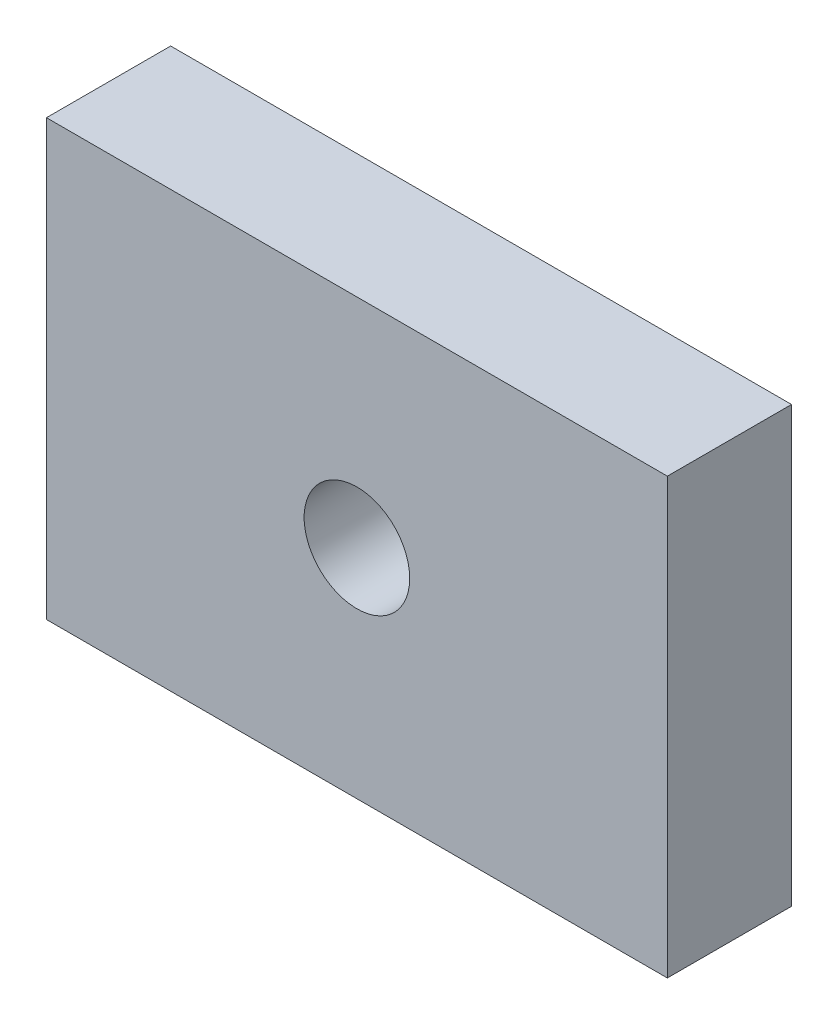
ISO-10303-21;
HEADER;
FILE_DESCRIPTION(('STEP AP214'),'2;1');
FILE_NAME('part.step','',(''),(''),'','','');
FILE_SCHEMA(('AUTOMOTIVE_DESIGN { 1 0 10303 214 1 1 1 1 }'));
ENDSEC;
DATA;
#1=APPLICATION_CONTEXT('core data for automotive mechanical design processes');
#2=APPLICATION_PROTOCOL_DEFINITION('international standard','automotive_design',2000,#1);
#3=PRODUCT_CONTEXT('',#1,'mechanical');
#4=PRODUCT('Part','Part','',(#3));
#5=PRODUCT_RELATED_PRODUCT_CATEGORY('part','',(#4));
#6=PRODUCT_DEFINITION_FORMATION('','',#4);
#7=PRODUCT_DEFINITION_CONTEXT('part definition',#1,'design');
#8=PRODUCT_DEFINITION('design','',#6,#7);
#9=PRODUCT_DEFINITION_SHAPE('','',#8);
#10=(LENGTH_UNIT() NAMED_UNIT(*) SI_UNIT(.MILLI.,.METRE.));
#11=(NAMED_UNIT(*) PLANE_ANGLE_UNIT() SI_UNIT($,.RADIAN.));
#12=(NAMED_UNIT(*) SI_UNIT($,.STERADIAN.) SOLID_ANGLE_UNIT());
#13=UNCERTAINTY_MEASURE_WITH_UNIT(LENGTH_MEASURE(1.E-05),#10,'distance_accuracy_value','');
#14=(GEOMETRIC_REPRESENTATION_CONTEXT(3) GLOBAL_UNCERTAINTY_ASSIGNED_CONTEXT((#13)) GLOBAL_UNIT_ASSIGNED_CONTEXT((#10,
#11,#12)) REPRESENTATION_CONTEXT('',''));
#15=CARTESIAN_POINT('',(0.,0.,0.));
#16=DIRECTION('',(0.,0.,1.));
#17=DIRECTION('',(1.,0.,0.));
#18=AXIS2_PLACEMENT_3D('',#15,#16,#17);
#19=CARTESIAN_POINT('',(0.,0.,10.));
#20=DIRECTION('',(1.,0.,0.));
#21=DIRECTION('',(0.,0.,-1.));
#22=AXIS2_PLACEMENT_3D('',#19,#20,#21);
#23=PLANE('',#22);
#24=DIRECTION('',(0.,-1.,0.));
#25=VECTOR('',#24,1.);
#26=CARTESIAN_POINT('',(0.,0.,0.));
#27=LINE('',#26,#25);
#28=CARTESIAN_POINT('',(0.,35.,0.));
#29=VERTEX_POINT('',#28);
#30=CARTESIAN_POINT('',(0.,0.,0.));
#31=VERTEX_POINT('',#30);
#32=EDGE_CURVE('E96',#29,#31,#27,.T.);
#33=ORIENTED_EDGE('',*,*,#32,.T.);
#34=DIRECTION('',(0.,0.,-1.));
#35=VECTOR('',#34,1.);
#36=CARTESIAN_POINT('',(0.,0.,10.));
#37=LINE('',#36,#35);
#38=CARTESIAN_POINT('',(0.,0.,10.));
#39=VERTEX_POINT('',#38);
#40=EDGE_CURVE('E11',#39,#31,#37,.T.);
#41=ORIENTED_EDGE('',*,*,#40,.F.);
#42=DIRECTION('',(0.,-1.,0.));
#43=VECTOR('',#42,1.);
#44=CARTESIAN_POINT('',(0.,0.,10.));
#45=LINE('',#44,#43);
#46=CARTESIAN_POINT('',(0.,35.,10.));
#47=VERTEX_POINT('',#46);
#48=EDGE_CURVE('E83',#47,#39,#45,.T.);
#49=ORIENTED_EDGE('',*,*,#48,.F.);
#50=DIRECTION('',(0.,0.,-1.));
#51=VECTOR('',#50,1.);
#52=CARTESIAN_POINT('',(0.,35.,10.));
#53=LINE('',#52,#51);
#54=EDGE_CURVE('E92',#47,#29,#53,.T.);
#55=ORIENTED_EDGE('',*,*,#54,.T.);
#56=EDGE_LOOP('',(#33,#41,#49,#55));
#57=FACE_BOUND('',#56,.T.);
#58=ADVANCED_FACE('F31',(#57),#23,.F.);
#59=CARTESIAN_POINT('',(0.,0.,10.));
#60=DIRECTION('',(0.,1.,0.));
#61=DIRECTION('',(0.,0.,1.));
#62=AXIS2_PLACEMENT_3D('',#59,#60,#61);
#63=PLANE('',#62);
#64=DIRECTION('',(1.,0.,0.));
#65=VECTOR('',#64,1.);
#66=CARTESIAN_POINT('',(0.,0.,0.));
#67=LINE('',#66,#65);
#68=CARTESIAN_POINT('',(50.,0.,0.));
#69=VERTEX_POINT('',#68);
#70=EDGE_CURVE('E87',#31,#69,#67,.T.);
#71=ORIENTED_EDGE('',*,*,#70,.T.);
#72=DIRECTION('',(0.,0.,-1.));
#73=VECTOR('',#72,1.);
#74=CARTESIAN_POINT('',(50.,0.,10.));
#75=LINE('',#74,#73);
#76=CARTESIAN_POINT('',(50.,0.,10.));
#77=VERTEX_POINT('',#76);
#78=EDGE_CURVE('E40',#77,#69,#75,.T.);
#79=ORIENTED_EDGE('',*,*,#78,.F.);
#80=DIRECTION('',(1.,0.,0.));
#81=VECTOR('',#80,1.);
#82=CARTESIAN_POINT('',(0.,0.,10.));
#83=LINE('',#82,#81);
#84=EDGE_CURVE('E78',#39,#77,#83,.T.);
#85=ORIENTED_EDGE('',*,*,#84,.F.);
#86=ORIENTED_EDGE('',*,*,#40,.T.);
#87=EDGE_LOOP('',(#71,#79,#85,#86));
#88=FACE_BOUND('',#87,.T.);
#89=ADVANCED_FACE('F86',(#88),#63,.F.);
#90=CARTESIAN_POINT('',(50.,0.,10.));
#91=DIRECTION('',(-1.,0.,0.));
#92=DIRECTION('',(0.,0.,1.));
#93=AXIS2_PLACEMENT_3D('',#90,#91,#92);
#94=PLANE('',#93);
#95=DIRECTION('',(0.,1.,0.));
#96=VECTOR('',#95,1.);
#97=CARTESIAN_POINT('',(50.,0.,0.));
#98=LINE('',#97,#96);
#99=CARTESIAN_POINT('',(50.,35.,0.));
#100=VERTEX_POINT('',#99);
#101=EDGE_CURVE('E65',#69,#100,#98,.T.);
#102=ORIENTED_EDGE('',*,*,#101,.T.);
#103=DIRECTION('',(0.,0.,-1.));
#104=VECTOR('',#103,1.);
#105=CARTESIAN_POINT('',(50.,35.,10.));
#106=LINE('',#105,#104);
#107=CARTESIAN_POINT('',(50.,35.,10.));
#108=VERTEX_POINT('',#107);
#109=EDGE_CURVE('E88',#108,#100,#106,.T.);
#110=ORIENTED_EDGE('',*,*,#109,.F.);
#111=DIRECTION('',(0.,1.,0.));
#112=VECTOR('',#111,1.);
#113=CARTESIAN_POINT('',(50.,0.,10.));
#114=LINE('',#113,#112);
#115=EDGE_CURVE('E81',#77,#108,#114,.T.);
#116=ORIENTED_EDGE('',*,*,#115,.F.);
#117=ORIENTED_EDGE('',*,*,#78,.T.);
#118=EDGE_LOOP('',(#102,#110,#116,#117));
#119=FACE_BOUND('',#118,.T.);
#120=ADVANCED_FACE('F90',(#119),#94,.F.);
#121=CARTESIAN_POINT('',(0.,35.,10.));
#122=DIRECTION('',(0.,-1.,0.));
#123=DIRECTION('',(0.,0.,-1.));
#124=AXIS2_PLACEMENT_3D('',#121,#122,#123);
#125=PLANE('',#124);
#126=DIRECTION('',(-1.,0.,0.));
#127=VECTOR('',#126,1.);
#128=CARTESIAN_POINT('',(0.,35.,0.));
#129=LINE('',#128,#127);
#130=EDGE_CURVE('E71',#100,#29,#129,.T.);
#131=ORIENTED_EDGE('',*,*,#130,.T.);
#132=ORIENTED_EDGE('',*,*,#54,.F.);
#133=DIRECTION('',(-1.,0.,0.));
#134=VECTOR('',#133,1.);
#135=CARTESIAN_POINT('',(0.,35.,10.));
#136=LINE('',#135,#134);
#137=EDGE_CURVE('E48',#108,#47,#136,.T.);
#138=ORIENTED_EDGE('',*,*,#137,.F.);
#139=ORIENTED_EDGE('',*,*,#109,.T.);
#140=EDGE_LOOP('',(#131,#132,#138,#139));
#141=FACE_BOUND('',#140,.T.);
#142=ADVANCED_FACE('F103',(#141),#125,.F.);
#143=CARTESIAN_POINT('',(0.,35.,10.));
#144=DIRECTION('',(0.,0.,-1.));
#145=DIRECTION('',(-1.,0.,0.));
#146=AXIS2_PLACEMENT_3D('',#143,#144,#145);
#147=PLANE('',#146);
#148=CARTESIAN_POINT('',(25.,17.5,10.));
#149=DIRECTION('',(0.,0.,1.));
#150=DIRECTION('',(1.,0.,0.));
#151=AXIS2_PLACEMENT_3D('',#148,#149,#150);
#152=CIRCLE('',#151,4.24999999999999);
#153=CARTESIAN_POINT('',(29.25,17.5,10.));
#154=VERTEX_POINT('',#153);
#155=EDGE_CURVE('E109',#154,#154,#152,.T.);
#156=ORIENTED_EDGE('',*,*,#155,.F.);
#157=EDGE_LOOP('',(#156));
#158=FACE_BOUND('',#157,.T.);
#159=ORIENTED_EDGE('',*,*,#48,.T.);
#160=ORIENTED_EDGE('',*,*,#84,.T.);
#161=ORIENTED_EDGE('',*,*,#115,.T.);
#162=ORIENTED_EDGE('',*,*,#137,.T.);
#163=EDGE_LOOP('',(#159,#160,#161,#162));
#164=FACE_BOUND('',#163,.T.);
#165=ADVANCED_FACE('F79',(#158,#164),#147,.F.);
#166=CARTESIAN_POINT('',(0.,35.,0.));
#167=DIRECTION('',(0.,0.,-1.));
#168=DIRECTION('',(-1.,0.,0.));
#169=AXIS2_PLACEMENT_3D('',#166,#167,#168);
#170=PLANE('',#169);
#171=CARTESIAN_POINT('',(25.,17.5,0.));
#172=DIRECTION('',(0.,0.,-1.));
#173=DIRECTION('',(-1.,0.,0.));
#174=AXIS2_PLACEMENT_3D('',#171,#172,#173);
#175=CIRCLE('',#174,4.24999999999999);
#176=CARTESIAN_POINT('',(20.75,17.5,0.));
#177=VERTEX_POINT('',#176);
#178=EDGE_CURVE('E34',#177,#177,#175,.T.);
#179=ORIENTED_EDGE('',*,*,#178,.F.);
#180=EDGE_LOOP('',(#179));
#181=FACE_BOUND('',#180,.T.);
#182=ORIENTED_EDGE('',*,*,#32,.F.);
#183=ORIENTED_EDGE('',*,*,#130,.F.);
#184=ORIENTED_EDGE('',*,*,#101,.F.);
#185=ORIENTED_EDGE('',*,*,#70,.F.);
#186=EDGE_LOOP('',(#182,#183,#184,#185));
#187=FACE_BOUND('',#186,.T.);
#188=ADVANCED_FACE('F106',(#181,#187),#170,.T.);
#189=CARTESIAN_POINT('',(25.,17.5,10.));
#190=DIRECTION('',(0.,0.,1.));
#191=DIRECTION('',(1.,0.,0.));
#192=AXIS2_PLACEMENT_3D('',#189,#190,#191);
#193=CYLINDRICAL_SURFACE('',#192,4.24999999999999);
#194=ORIENTED_EDGE('',*,*,#178,.T.);
#195=EDGE_LOOP('',(#194));
#196=FACE_BOUND('',#195,.T.);
#197=ORIENTED_EDGE('',*,*,#155,.T.);
#198=EDGE_LOOP('',(#197));
#199=FACE_BOUND('',#198,.T.);
#200=ADVANCED_FACE('F116',(#196,#199),#193,.F.);
#201=CLOSED_SHELL('',(#58,#89,#120,#142,#165,#188,#200));
#202=MANIFOLD_SOLID_BREP('B2',#201);
#203=ADVANCED_BREP_SHAPE_REPRESENTATION('',(#18,#202),#14);
#204=SHAPE_DEFINITION_REPRESENTATION(#9,#203);
ENDSEC;
END-ISO-10303-21;
